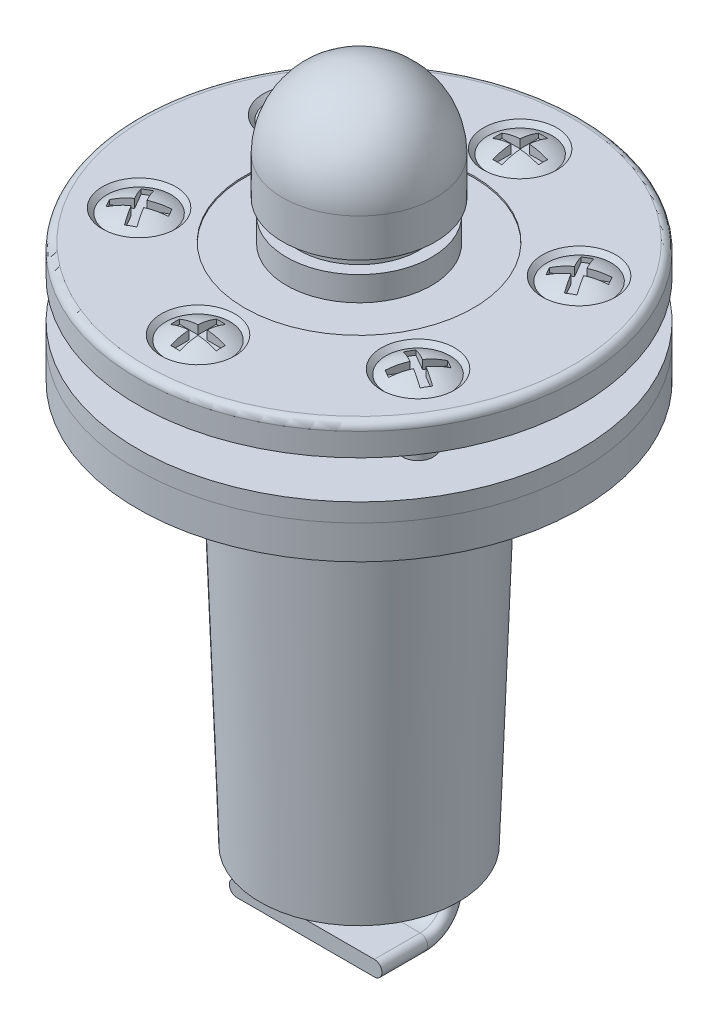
from build123d import *

# Parameters (mm, degrees)
CONG_1_R                                       = 0.5
FRAISAGE_POUR_VIS_T_TE_FRAIS_E_M21_D           = 2.3
FRAISAGE_POUR_VIS_T_TE_FRAIS_E_M21_CSINK_D     = 4.8
FRAISAGE_POUR_VIS_T_TE_FRAIS_E_M21_CSINK_ANGLE = 90
ESQUISSE6_R                                    = 14.5
ESQUISSE6_R_2                                  = 7.75
BOSS_EXTRU_1_DEPTH                             = 1.2
ESQUISSE7_R                                    = 14.5
ESQUISSE7_R_2                                  = 7.75
BOSS_EXTRU_2_DEPTH                             = 2.2
ENL_V_MAT_EXTRU_1_DEPTH                        = 43.916081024
ENL_V_MAT_EXTRU_1_DEPTH_BACK                   = 0.3
R_P_TITION_CIRCULAIRE1_COUNT                   = 6


with BuildPart() as part:
    # Esquisse1 → R_volution1 (revolve)
    with BuildSketch(Plane.XY, mode=Mode.PRIVATE) as r_volution1_sk:
        Polygon((0, 0), (0, 25.1), (-4.75, 25.1), (-4.75, 34.1), (-7.5, 34.1), (-7.5, 34.2), (-14.5, 34.2), (-14.5, 32.2), (-7.6, 32.2), (-6.5, 0), align=None)
    revolve(r_volution1_sk.sketch.rotate(Axis((0, 0, 0), (0, 1, 0)), 270), axis=Axis((0, 0, 0), (0, 1, 0)))

    # Cong_1
    cong_1_edges = [part.edges().sort_by_distance(p)[0] for p in [
        (0, 34.2, 14.5),
    ]]
    fillet(cong_1_edges, radius=CONG_1_R)

    # Fraisage pour vis _ t_te frais_e M21 (through all)
    with Locations(Plane(origin=(0, 34.2, 0), x_dir=(1, 0, 0), z_dir=(0, 1, 0))):
        with Locations((0, 10.55), (-9.13656801, 5.275), (-9.13656801, -5.275), (0, -10.55), (9.13656801, -5.275), (9.13656801, 5.275)):
            CounterSinkHole(FRAISAGE_POUR_VIS_T_TE_FRAIS_E_M21_D / 2, FRAISAGE_POUR_VIS_T_TE_FRAIS_E_M21_CSINK_D / 2, counter_sink_angle=FRAISAGE_POUR_VIS_T_TE_FRAIS_E_M21_CSINK_ANGLE)

    # Balayage1: sweep along a path in Esquisse5
    with BuildLine(Plane(origin=(0, 0, 0), x_dir=(0, 0, -1), z_dir=(1, 0, 0))) as balayage1_path:
        Line((1.5, 0), (1.5, -1))
        ThreePointArc((1.5, -1), (0.914213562, -2.414213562), (-0.5, -3))
        Line((-0.5, -3), (-3.5, -3))
    # Esquisse4 → Balayage1 (sweep)
    with BuildSketch(Plane.XZ):
        with BuildLine():
            Line((-4.5, -1), (4.5, -1))
            ThreePointArc((4.5, -1), (5, -1.5), (4.5, -2))
            Line((4.5, -2), (-4.5, -2))
            ThreePointArc((-4.5, -2), (-5, -1.5), (-4.5, -1))
        make_face()
    sweep(path=balayage1_path.line)


with BuildPart() as body_2:
    # Esquisse6 → Boss.-Extru.1 (new body)
    with BuildSketch(Plane(origin=(0, 29.7, 0), x_dir=(-1, 0, 0), z_dir=(0, -1, 0))):
        with Locations(Location((0, 0, 0), (0, 0, 90))):
            Circle(ESQUISSE6_R)
        with Locations(Location((0, 0, 0), (0, 0, 90))):
            Circle(ESQUISSE6_R_2, mode=Mode.SUBTRACT)
    extrude(amount=BOSS_EXTRU_1_DEPTH)


with BuildPart() as body_3:
    # Esquisse7 → Boss.-Extru.2 (new body)
    with BuildSketch(Plane.XZ.offset(-28.5)):
        with Locations(Location((0, 0, 0), (0, 0, 270))):
            Circle(ESQUISSE7_R)
        with Locations(Location((0, 0, 0), (0, 0, 270))):
            Circle(ESQUISSE7_R_2, mode=Mode.SUBTRACT)
    extrude(amount=BOSS_EXTRU_2_DEPTH)


with BuildPart() as body_4:
    # Esquisse8 → R_volution2 (revolve)
    with BuildSketch(Plane(origin=(0, 0, 0), x_dir=(0, 0, -1), z_dir=(1, 0, 0))):
        with BuildLine():
            Line((-12.65, 33.9), (-11.55, 32.8))
            Line((-11.55, 32.8), (-11.55, 24.4))
            Line((-11.55, 24.4), (-10.55, 24.4))
            Line((-10.55, 24.4), (-10.55, 34.5))
            ThreePointArc((-10.55, 34.5), (-11.642016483, 34.347057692), (-12.65, 33.9))
        make_face()
    revolve(axis=Axis((0, 32.95, 10.55), (0, -1, 0)))

    # Esquisse9 → Enl_v. mat.-Extru.1 (cut, two sides: drawn at the far end of the back side and taken through both)
    with BuildSketch(Plane(origin=(0, 34.2, 0), x_dir=(1, 0, 0), z_dir=(0, 1, 0)).offset(-ENL_V_MAT_EXTRU_1_DEPTH_BACK)):
        Polygon((-0.3, -10.25), (-0.3, -9.05), (0.3, -9.05), (0.3, -10.25), (1.5, -10.25), (1.5, -10.85), (0.3, -10.85), (0.3, -12.05), (-0.3, -12.05), (-0.3, -10.85), (-1.5, -10.85), (-1.5, -10.25), align=None)
    extrude(amount=ENL_V_MAT_EXTRU_1_DEPTH + ENL_V_MAT_EXTRU_1_DEPTH_BACK, mode=Mode.SUBTRACT)


with BuildPart() as r_p_tition_circulaire1_1:
    # R_p_tition circulaire1: pattern copy
    add(body_4.part.rotate(Axis((0, 0, 0), (0, 1, 0)), 1 * 360 / R_P_TITION_CIRCULAIRE1_COUNT))


with BuildPart() as r_p_tition_circulaire1_2:
    # R_p_tition circulaire1: pattern copy
    add(body_4.part.rotate(Axis((0, 0, 0), (0, 1, 0)), 2 * 360 / R_P_TITION_CIRCULAIRE1_COUNT))


with BuildPart() as r_p_tition_circulaire1_3:
    # R_p_tition circulaire1: pattern copy
    add(body_4.part.rotate(Axis((0, 0, 0), (0, 1, 0)), 3 * 360 / R_P_TITION_CIRCULAIRE1_COUNT))


with BuildPart() as r_p_tition_circulaire1_4:
    # R_p_tition circulaire1: pattern copy
    add(body_4.part.rotate(Axis((0, 0, 0), (0, 1, 0)), 4 * 360 / R_P_TITION_CIRCULAIRE1_COUNT))


with BuildPart() as r_p_tition_circulaire1_5:
    # R_p_tition circulaire1: pattern copy
    add(body_4.part.rotate(Axis((0, 0, 0), (0, 1, 0)), 5 * 360 / R_P_TITION_CIRCULAIRE1_COUNT))


with BuildPart() as body_10:
    # Esquisse10 → R_volution3 (revolve)
    with BuildSketch(Plane.XY, mode=Mode.PRIVATE) as r_volution3_sk:
        with BuildLine():
            Line((0, 25.1), (-4.75, 25.1))
            Line((-4.75, 25.1), (-4.75, 35.7))
            Line((-4.75, 35.7), (-3.95, 35.7))
            Line((-3.95, 35.7), (-3.95, 36.7))
            Line((-3.95, 36.7), (-5, 36.7))
            Line((-5, 36.7), (-5, 39.2))
            ThreePointArc((-5, 39.2), (-3.535533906, 42.735533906), (0, 44.2))
            Line((0, 44.2), (0, 25.1))
        make_face()
    revolve(r_volution3_sk.sketch.rotate(Axis((0, 25.1, 0), (0, 1, 0)), 270), axis=Axis((0, 25.1, 0), (0, 1, 0)))


solid = Compound([part.part, body_2.part, body_3.part, body_4.part, r_p_tition_circulaire1_1.part, r_p_tition_circulaire1_2.part, r_p_tition_circulaire1_3.part, r_p_tition_circulaire1_4.part, r_p_tition_circulaire1_5.part, body_10.part])
